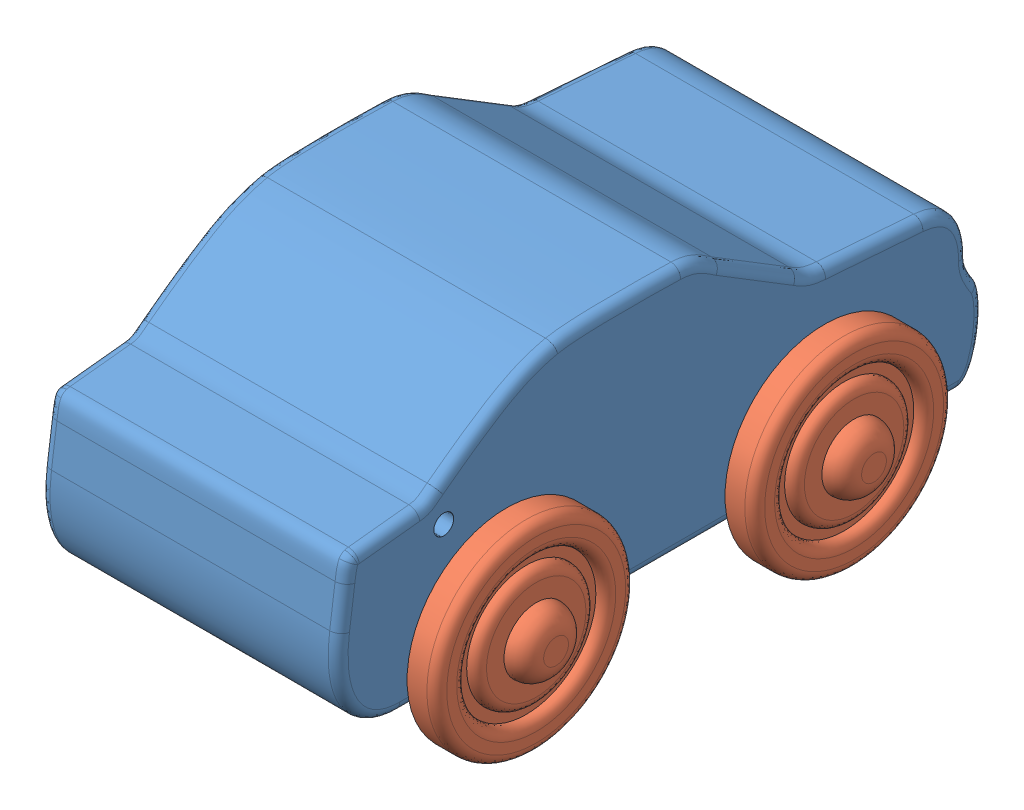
SolidWorks assembly Taxi Cab.SLDASM, configuration Default (file format 14000). Lengths in mm.
Overall size (41 32.75 66.18).
3 component instances, 2 part files, 4 mates.
Components (placement in the parent):
- Taxi-1: Taxi.SLDPRT [Default] at (73.3103 -2.8868 -1.8039) size (30.03 26.53 66.18)
- Car Wheels-1: Car Wheels.SLDPRT [Default] at (73.3103 0.2115 -15.9352) size (41 20 20)
- Car Wheels-2: Car Wheels.SLDPRT [Default] at (73.3103 0.2115 16.0648) size (41 20 20)
Mates (geometry in assembly coordinates):
- Concentric1: concentric aligned: cylinder of Taxi-1 through (88.3103 0.2115 16.0648) axis (-1 0 0) radius 1.5; cylinder of Car Wheels-2 through (91.8103 0.2115 16.0648) axis (-1 0 0) radius 1.25
- Concentric2: concentric aligned: cylinder of Taxi-1 through (88.3103 0.2115 -15.9352) axis (-1 0 0) radius 1.5; cylinder of Car Wheels-1 through (91.8103 0.2115 -15.9352) axis (-1 0 0) radius 1.25
- Distance1: distance = 0.5 mm anti-aligned: plane of Car Wheels-1 through (57.8103 0.2115 -15.9352) normal (1 0 0); plane of Taxi-1 through (58.3103 -2.8868 -1.8039) normal (-1 0 0)
- Distance2: distance = 0.5 mm anti-aligned: plane of Car Wheels-2 through (57.8103 0.2115 16.0648) normal (1 0 0); plane of Taxi-1 through (58.3103 -2.8868 -1.8039) normal (-1 0 0)
